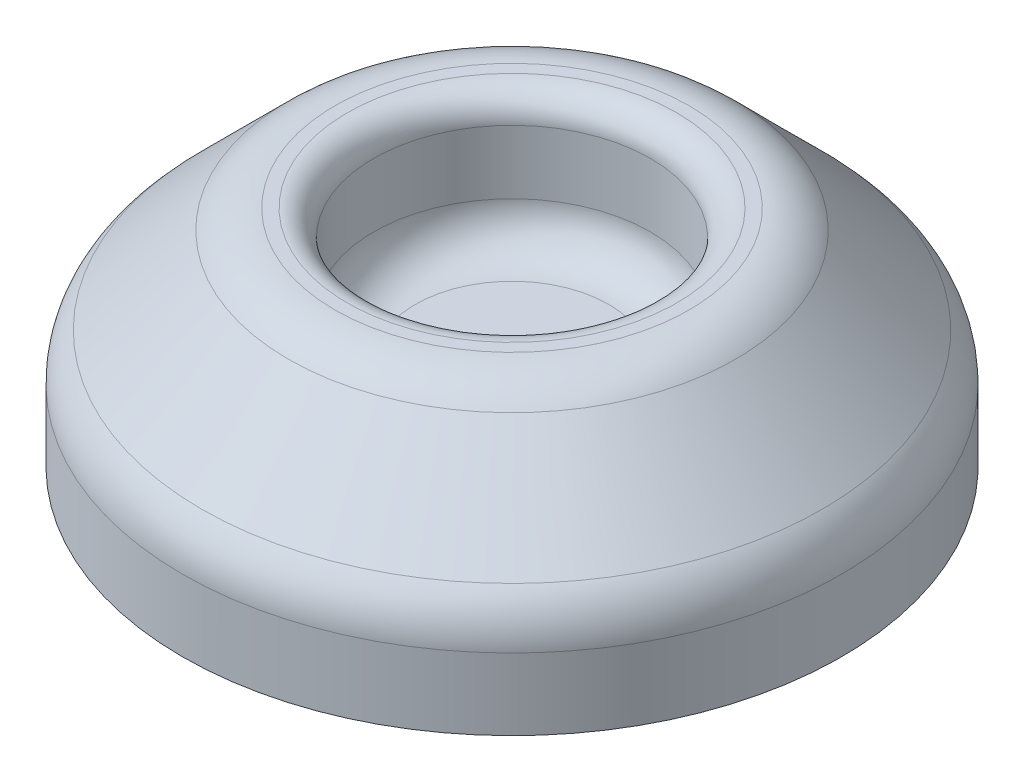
ISO-10303-21;
HEADER;
FILE_DESCRIPTION(('STEP AP214'),'2;1');
FILE_NAME('part.step','',(''),(''),'','','');
FILE_SCHEMA(('AUTOMOTIVE_DESIGN { 1 0 10303 214 1 1 1 1 }'));
ENDSEC;
DATA;
#1=APPLICATION_CONTEXT('core data for automotive mechanical design processes');
#2=APPLICATION_PROTOCOL_DEFINITION('international standard','automotive_design',2000,#1);
#3=PRODUCT_CONTEXT('',#1,'mechanical');
#4=PRODUCT('Part','Part','',(#3));
#5=PRODUCT_RELATED_PRODUCT_CATEGORY('part','',(#4));
#6=PRODUCT_DEFINITION_FORMATION('','',#4);
#7=PRODUCT_DEFINITION_CONTEXT('part definition',#1,'design');
#8=PRODUCT_DEFINITION('design','',#6,#7);
#9=PRODUCT_DEFINITION_SHAPE('','',#8);
#10=(LENGTH_UNIT() NAMED_UNIT(*) SI_UNIT(.MILLI.,.METRE.));
#11=(NAMED_UNIT(*) PLANE_ANGLE_UNIT() SI_UNIT($,.RADIAN.));
#12=(NAMED_UNIT(*) SI_UNIT($,.STERADIAN.) SOLID_ANGLE_UNIT());
#13=UNCERTAINTY_MEASURE_WITH_UNIT(LENGTH_MEASURE(1.E-05),#10,'distance_accuracy_value','');
#14=(GEOMETRIC_REPRESENTATION_CONTEXT(3) GLOBAL_UNCERTAINTY_ASSIGNED_CONTEXT((#13)) GLOBAL_UNIT_ASSIGNED_CONTEXT((#10,
#11,#12)) REPRESENTATION_CONTEXT('',''));
#15=CARTESIAN_POINT('',(0.,0.,0.));
#16=DIRECTION('',(0.,0.,1.));
#17=DIRECTION('',(1.,0.,0.));
#18=AXIS2_PLACEMENT_3D('',#15,#16,#17);
#19=CARTESIAN_POINT('',(0.,7.50000000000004,0.));
#20=DIRECTION('',(0.,-1.,0.));
#21=DIRECTION('',(0.,0.,-1.));
#22=AXIS2_PLACEMENT_3D('',#19,#20,#21);
#23=CONICAL_SURFACE('',#22,25.,0.78539816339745);
#24=CARTESIAN_POINT('',(0.,8.9644660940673,0.));
#25=DIRECTION('',(0.,1.,0.));
#26=DIRECTION('',(0.,0.,1.));
#27=AXIS2_PLACEMENT_3D('',#24,#25,#26);
#28=CIRCLE('',#27,23.5355339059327);
#29=CARTESIAN_POINT('',(0.,8.9644660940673,23.5355339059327));
#30=VERTEX_POINT('',#29);
#31=EDGE_CURVE('E57',#30,#30,#28,.T.);
#32=ORIENTED_EDGE('',*,*,#31,.T.);
#33=EDGE_LOOP('',(#32));
#34=FACE_BOUND('',#33,.T.);
#35=CARTESIAN_POINT('',(0.,15.5355339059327,0.));
#36=DIRECTION('',(0.,1.,0.));
#37=DIRECTION('',(0.,0.,1.));
#38=AXIS2_PLACEMENT_3D('',#35,#36,#37);
#39=CIRCLE('',#38,16.9644660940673);
#40=CARTESIAN_POINT('',(0.,15.5355339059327,16.9644660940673));
#41=VERTEX_POINT('',#40);
#42=EDGE_CURVE('E60',#41,#41,#39,.F.);
#43=ORIENTED_EDGE('',*,*,#42,.T.);
#44=EDGE_LOOP('',(#43));
#45=FACE_BOUND('',#44,.T.);
#46=ADVANCED_FACE('F31',(#34,#45),#23,.T.);
#47=CARTESIAN_POINT('',(15.5,17.,0.));
#48=DIRECTION('',(0.,-1.,0.));
#49=DIRECTION('',(0.,0.,-1.));
#50=AXIS2_PLACEMENT_3D('',#47,#48,#49);
#51=PLANE('',#50);
#52=CARTESIAN_POINT('',(0.,17.,0.));
#53=DIRECTION('',(0.,-1.,0.));
#54=DIRECTION('',(0.,0.,-1.));
#55=AXIS2_PLACEMENT_3D('',#52,#53,#54);
#56=CIRCLE('',#55,12.5);
#57=CARTESIAN_POINT('',(0.,17.,-12.5));
#58=VERTEX_POINT('',#57);
#59=EDGE_CURVE('E42',#58,#58,#56,.T.);
#60=ORIENTED_EDGE('',*,*,#59,.T.);
#61=EDGE_LOOP('',(#60));
#62=FACE_BOUND('',#61,.T.);
#63=CARTESIAN_POINT('',(0.,17.,0.));
#64=DIRECTION('',(0.,-1.,0.));
#65=DIRECTION('',(0.,0.,-1.));
#66=AXIS2_PLACEMENT_3D('',#63,#64,#65);
#67=CIRCLE('',#66,13.4289321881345);
#68=CARTESIAN_POINT('',(0.,17.,-13.4289321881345));
#69=VERTEX_POINT('',#68);
#70=EDGE_CURVE('E51',#69,#69,#67,.F.);
#71=ORIENTED_EDGE('',*,*,#70,.T.);
#72=EDGE_LOOP('',(#71));
#73=FACE_BOUND('',#72,.T.);
#74=ADVANCED_FACE('F122',(#62,#73),#51,.F.);
#75=CARTESIAN_POINT('',(0.,7.,0.));
#76=DIRECTION('',(0.,1.,0.));
#77=DIRECTION('',(0.,0.,1.));
#78=AXIS2_PLACEMENT_3D('',#75,#76,#77);
#79=CYLINDRICAL_SURFACE('',#78,10.5);
#80=CARTESIAN_POINT('',(0.,10.175,0.));
#81=DIRECTION('',(0.,-1.,0.));
#82=DIRECTION('',(0.,0.,-1.));
#83=AXIS2_PLACEMENT_3D('',#80,#81,#82);
#84=CIRCLE('',#83,10.5);
#85=CARTESIAN_POINT('',(0.,10.175,-10.5));
#86=VERTEX_POINT('',#85);
#87=EDGE_CURVE('E10',#86,#86,#84,.T.);
#88=ORIENTED_EDGE('',*,*,#87,.T.);
#89=EDGE_LOOP('',(#88));
#90=FACE_BOUND('',#89,.T.);
#91=CARTESIAN_POINT('',(0.,15.,0.));
#92=DIRECTION('',(0.,-1.,0.));
#93=DIRECTION('',(0.,0.,-1.));
#94=AXIS2_PLACEMENT_3D('',#91,#92,#93);
#95=CIRCLE('',#94,10.5);
#96=CARTESIAN_POINT('',(0.,15.,-10.5));
#97=VERTEX_POINT('',#96);
#98=EDGE_CURVE('E46',#97,#97,#95,.F.);
#99=ORIENTED_EDGE('',*,*,#98,.T.);
#100=EDGE_LOOP('',(#99));
#101=FACE_BOUND('',#100,.T.);
#102=ADVANCED_FACE('F128',(#90,#101),#79,.F.);
#103=CARTESIAN_POINT('',(10.5,7.,0.));
#104=DIRECTION('',(0.,-1.,0.));
#105=DIRECTION('',(0.,0.,-1.));
#106=AXIS2_PLACEMENT_3D('',#103,#104,#105);
#107=PLANE('',#106);
#108=CARTESIAN_POINT('',(0.,7.,0.));
#109=DIRECTION('',(0.,-1.,0.));
#110=DIRECTION('',(0.,0.,-1.));
#111=AXIS2_PLACEMENT_3D('',#108,#109,#110);
#112=CIRCLE('',#111,7.325);
#113=CARTESIAN_POINT('',(0.,7.,-7.325));
#114=VERTEX_POINT('',#113);
#115=EDGE_CURVE('E38',#114,#114,#112,.F.);
#116=ORIENTED_EDGE('',*,*,#115,.T.);
#117=EDGE_LOOP('',(#116));
#118=FACE_BOUND('',#117,.T.);
#119=ADVANCED_FACE('F154',(#118),#107,.F.);
#120=CARTESIAN_POINT('',(0.,0.,0.));
#121=DIRECTION('',(0.,1.,0.));
#122=DIRECTION('',(0.,0.,1.));
#123=AXIS2_PLACEMENT_3D('',#120,#121,#122);
#124=PLANE('',#123);
#125=CARTESIAN_POINT('',(0.,0.,0.));
#126=DIRECTION('',(0.,1.,0.));
#127=DIRECTION('',(0.,0.,1.));
#128=AXIS2_PLACEMENT_3D('',#125,#126,#127);
#129=CIRCLE('',#128,24.);
#130=CARTESIAN_POINT('',(0.,0.,24.));
#131=VERTEX_POINT('',#130);
#132=EDGE_CURVE('E67',#131,#131,#129,.T.);
#133=ORIENTED_EDGE('',*,*,#132,.T.);
#134=EDGE_LOOP('',(#133));
#135=FACE_BOUND('',#134,.T.);
#136=CARTESIAN_POINT('',(0.,0.,0.));
#137=DIRECTION('',(0.,1.,0.));
#138=DIRECTION('',(0.,0.,1.));
#139=AXIS2_PLACEMENT_3D('',#136,#137,#138);
#140=CIRCLE('',#139,25.);
#141=CARTESIAN_POINT('',(0.,0.,25.));
#142=VERTEX_POINT('',#141);
#143=EDGE_CURVE('E63',#142,#142,#140,.T.);
#144=ORIENTED_EDGE('',*,*,#143,.F.);
#145=EDGE_LOOP('',(#144));
#146=FACE_BOUND('',#145,.T.);
#147=ADVANCED_FACE('F158',(#135,#146),#124,.F.);
#148=CARTESIAN_POINT('',(0.,7.,0.));
#149=DIRECTION('',(0.,1.,0.));
#150=DIRECTION('',(0.,0.,1.));
#151=AXIS2_PLACEMENT_3D('',#148,#149,#150);
#152=CYLINDRICAL_SURFACE('',#151,25.);
#153=CARTESIAN_POINT('',(0.,5.42893218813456,0.));
#154=DIRECTION('',(0.,-1.,0.));
#155=DIRECTION('',(0.,0.,-1.));
#156=AXIS2_PLACEMENT_3D('',#153,#154,#155);
#157=CIRCLE('',#156,25.);
#158=CARTESIAN_POINT('',(0.,5.42893218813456,-25.));
#159=VERTEX_POINT('',#158);
#160=EDGE_CURVE('E54',#159,#159,#157,.T.);
#161=ORIENTED_EDGE('',*,*,#160,.T.);
#162=EDGE_LOOP('',(#161));
#163=FACE_BOUND('',#162,.T.);
#164=ORIENTED_EDGE('',*,*,#143,.T.);
#165=EDGE_LOOP('',(#164));
#166=FACE_BOUND('',#165,.T.);
#167=ADVANCED_FACE('F138',(#163,#166),#152,.T.);
#168=CARTESIAN_POINT('',(0.,5.42893218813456,0.));
#169=DIRECTION('',(0.,-1.,0.));
#170=DIRECTION('',(0.,0.,-1.));
#171=AXIS2_PLACEMENT_3D('',#168,#169,#170);
#172=TOROIDAL_SURFACE('',#171,20.,5.);
#173=ORIENTED_EDGE('',*,*,#160,.F.);
#174=EDGE_LOOP('',(#173));
#175=FACE_BOUND('',#174,.T.);
#176=ORIENTED_EDGE('',*,*,#31,.F.);
#177=EDGE_LOOP('',(#176));
#178=FACE_BOUND('',#177,.T.);
#179=ADVANCED_FACE('F134',(#175,#178),#172,.T.);
#180=CARTESIAN_POINT('',(0.,12.,0.));
#181=DIRECTION('',(0.,-1.,0.));
#182=DIRECTION('',(0.,0.,-1.));
#183=AXIS2_PLACEMENT_3D('',#180,#181,#182);
#184=TOROIDAL_SURFACE('',#183,13.4289321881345,5.);
#185=ORIENTED_EDGE('',*,*,#42,.F.);
#186=EDGE_LOOP('',(#185));
#187=FACE_BOUND('',#186,.T.);
#188=ORIENTED_EDGE('',*,*,#70,.F.);
#189=EDGE_LOOP('',(#188));
#190=FACE_BOUND('',#189,.T.);
#191=ADVANCED_FACE('F137',(#187,#190),#184,.T.);
#192=CARTESIAN_POINT('',(0.,15.,0.));
#193=DIRECTION('',(0.,-1.,0.));
#194=DIRECTION('',(0.,0.,-1.));
#195=AXIS2_PLACEMENT_3D('',#192,#193,#194);
#196=TOROIDAL_SURFACE('',#195,12.5,2.);
#197=ORIENTED_EDGE('',*,*,#59,.F.);
#198=EDGE_LOOP('',(#197));
#199=FACE_BOUND('',#198,.T.);
#200=ORIENTED_EDGE('',*,*,#98,.F.);
#201=EDGE_LOOP('',(#200));
#202=FACE_BOUND('',#201,.T.);
#203=ADVANCED_FACE('F141',(#199,#202),#196,.T.);
#204=CARTESIAN_POINT('',(0.,10.175,0.));
#205=DIRECTION('',(0.,-1.,0.));
#206=DIRECTION('',(0.,0.,-1.));
#207=AXIS2_PLACEMENT_3D('',#204,#205,#206);
#208=TOROIDAL_SURFACE('',#207,7.325,3.175);
#209=ORIENTED_EDGE('',*,*,#87,.F.);
#210=EDGE_LOOP('',(#209));
#211=FACE_BOUND('',#210,.T.);
#212=ORIENTED_EDGE('',*,*,#115,.F.);
#213=EDGE_LOOP('',(#212));
#214=FACE_BOUND('',#213,.T.);
#215=ADVANCED_FACE('F33',(#211,#214),#208,.F.);
#216=CARTESIAN_POINT('',(0.,6.79289321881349,0.));
#217=DIRECTION('',(0.,-1.,0.));
#218=DIRECTION('',(0.,0.,-1.));
#219=AXIS2_PLACEMENT_3D('',#216,#217,#218);
#220=CONICAL_SURFACE('',#219,24.2928932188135,0.78539816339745);
#221=CARTESIAN_POINT('',(0.,8.25735931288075,0.));
#222=DIRECTION('',(0.,-1.,0.));
#223=DIRECTION('',(0.,0.,-1.));
#224=AXIS2_PLACEMENT_3D('',#221,#222,#223);
#225=CIRCLE('',#224,22.8284271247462);
#226=CARTESIAN_POINT('',(0.,8.25735931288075,-22.8284271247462));
#227=VERTEX_POINT('',#226);
#228=EDGE_CURVE('E88',#227,#227,#225,.F.);
#229=ORIENTED_EDGE('',*,*,#228,.F.);
#230=EDGE_LOOP('',(#229));
#231=FACE_BOUND('',#230,.T.);
#232=CARTESIAN_POINT('',(0.,14.8284271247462,0.));
#233=DIRECTION('',(0.,-1.,0.));
#234=DIRECTION('',(0.,0.,-1.));
#235=AXIS2_PLACEMENT_3D('',#232,#233,#234);
#236=CIRCLE('',#235,16.2573593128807);
#237=CARTESIAN_POINT('',(0.,14.8284271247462,-16.2573593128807));
#238=VERTEX_POINT('',#237);
#239=EDGE_CURVE('E70',#238,#238,#236,.T.);
#240=ORIENTED_EDGE('',*,*,#239,.F.);
#241=EDGE_LOOP('',(#240));
#242=FACE_BOUND('',#241,.T.);
#243=ADVANCED_FACE('F96',(#231,#242),#220,.F.);
#244=CARTESIAN_POINT('',(15.5,16.,0.));
#245=DIRECTION('',(0.,-1.,0.));
#246=DIRECTION('',(0.,0.,-1.));
#247=AXIS2_PLACEMENT_3D('',#244,#245,#246);
#248=PLANE('',#247);
#249=CARTESIAN_POINT('',(0.,16.,0.));
#250=DIRECTION('',(0.,-1.,0.));
#251=DIRECTION('',(0.,0.,-1.));
#252=AXIS2_PLACEMENT_3D('',#249,#250,#251);
#253=CIRCLE('',#252,12.5);
#254=CARTESIAN_POINT('',(0.,16.,-12.5));
#255=VERTEX_POINT('',#254);
#256=EDGE_CURVE('E74',#255,#255,#253,.T.);
#257=ORIENTED_EDGE('',*,*,#256,.F.);
#258=EDGE_LOOP('',(#257));
#259=FACE_BOUND('',#258,.T.);
#260=CARTESIAN_POINT('',(0.,16.,0.));
#261=DIRECTION('',(0.,-1.,0.));
#262=DIRECTION('',(0.,0.,-1.));
#263=AXIS2_PLACEMENT_3D('',#260,#261,#262);
#264=CIRCLE('',#263,13.4289321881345);
#265=CARTESIAN_POINT('',(0.,16.,-13.4289321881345));
#266=VERTEX_POINT('',#265);
#267=EDGE_CURVE('E80',#266,#266,#264,.F.);
#268=ORIENTED_EDGE('',*,*,#267,.F.);
#269=EDGE_LOOP('',(#268));
#270=FACE_BOUND('',#269,.T.);
#271=ADVANCED_FACE('F99',(#259,#270),#248,.T.);
#272=CARTESIAN_POINT('',(0.,7.,0.));
#273=DIRECTION('',(0.,1.,0.));
#274=DIRECTION('',(0.,0.,1.));
#275=AXIS2_PLACEMENT_3D('',#272,#273,#274);
#276=CYLINDRICAL_SURFACE('',#275,11.5);
#277=CARTESIAN_POINT('',(0.,10.175,0.));
#278=DIRECTION('',(0.,1.,0.));
#279=DIRECTION('',(0.,0.,1.));
#280=AXIS2_PLACEMENT_3D('',#277,#278,#279);
#281=CIRCLE('',#280,11.5);
#282=CARTESIAN_POINT('',(0.,10.175,11.5));
#283=VERTEX_POINT('',#282);
#284=EDGE_CURVE('E66',#283,#283,#281,.F.);
#285=ORIENTED_EDGE('',*,*,#284,.F.);
#286=EDGE_LOOP('',(#285));
#287=FACE_BOUND('',#286,.T.);
#288=CARTESIAN_POINT('',(0.,15.,0.));
#289=DIRECTION('',(0.,1.,0.));
#290=DIRECTION('',(0.,0.,1.));
#291=AXIS2_PLACEMENT_3D('',#288,#289,#290);
#292=CIRCLE('',#291,11.5);
#293=CARTESIAN_POINT('',(0.,15.,11.5));
#294=VERTEX_POINT('',#293);
#295=EDGE_CURVE('E77',#294,#294,#292,.T.);
#296=ORIENTED_EDGE('',*,*,#295,.F.);
#297=EDGE_LOOP('',(#296));
#298=FACE_BOUND('',#297,.T.);
#299=ADVANCED_FACE('F111',(#287,#298),#276,.T.);
#300=CARTESIAN_POINT('',(10.5,6.,0.));
#301=DIRECTION('',(0.,-1.,0.));
#302=DIRECTION('',(0.,0.,-1.));
#303=AXIS2_PLACEMENT_3D('',#300,#301,#302);
#304=PLANE('',#303);
#305=CARTESIAN_POINT('',(0.,6.,0.));
#306=DIRECTION('',(0.,-1.,0.));
#307=DIRECTION('',(0.,0.,-1.));
#308=AXIS2_PLACEMENT_3D('',#305,#306,#307);
#309=CIRCLE('',#308,7.325);
#310=CARTESIAN_POINT('',(0.,6.,-7.325));
#311=VERTEX_POINT('',#310);
#312=EDGE_CURVE('E71',#311,#311,#309,.F.);
#313=ORIENTED_EDGE('',*,*,#312,.F.);
#314=EDGE_LOOP('',(#313));
#315=FACE_BOUND('',#314,.T.);
#316=ADVANCED_FACE('F117',(#315),#304,.T.);
#317=CARTESIAN_POINT('',(0.,7.,0.));
#318=DIRECTION('',(0.,1.,0.));
#319=DIRECTION('',(0.,0.,1.));
#320=AXIS2_PLACEMENT_3D('',#317,#318,#319);
#321=CYLINDRICAL_SURFACE('',#320,24.);
#322=CARTESIAN_POINT('',(0.,5.42893218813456,0.));
#323=DIRECTION('',(0.,1.,0.));
#324=DIRECTION('',(0.,0.,1.));
#325=AXIS2_PLACEMENT_3D('',#322,#323,#324);
#326=CIRCLE('',#325,24.);
#327=CARTESIAN_POINT('',(0.,5.42893218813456,24.));
#328=VERTEX_POINT('',#327);
#329=EDGE_CURVE('E85',#328,#328,#326,.F.);
#330=ORIENTED_EDGE('',*,*,#329,.F.);
#331=EDGE_LOOP('',(#330));
#332=FACE_BOUND('',#331,.T.);
#333=ORIENTED_EDGE('',*,*,#132,.F.);
#334=EDGE_LOOP('',(#333));
#335=FACE_BOUND('',#334,.T.);
#336=ADVANCED_FACE('F176',(#332,#335),#321,.F.);
#337=CARTESIAN_POINT('',(0.,5.42893218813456,0.));
#338=DIRECTION('',(0.,-1.,0.));
#339=DIRECTION('',(0.,0.,-1.));
#340=AXIS2_PLACEMENT_3D('',#337,#338,#339);
#341=TOROIDAL_SURFACE('',#340,20.,4.);
#342=ORIENTED_EDGE('',*,*,#329,.T.);
#343=EDGE_LOOP('',(#342));
#344=FACE_BOUND('',#343,.T.);
#345=ORIENTED_EDGE('',*,*,#228,.T.);
#346=EDGE_LOOP('',(#345));
#347=FACE_BOUND('',#346,.T.);
#348=ADVANCED_FACE('F94',(#344,#347),#341,.F.);
#349=CARTESIAN_POINT('',(0.,12.,0.));
#350=DIRECTION('',(0.,-1.,0.));
#351=DIRECTION('',(0.,0.,-1.));
#352=AXIS2_PLACEMENT_3D('',#349,#350,#351);
#353=TOROIDAL_SURFACE('',#352,13.4289321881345,4.);
#354=ORIENTED_EDGE('',*,*,#239,.T.);
#355=EDGE_LOOP('',(#354));
#356=FACE_BOUND('',#355,.T.);
#357=ORIENTED_EDGE('',*,*,#267,.T.);
#358=EDGE_LOOP('',(#357));
#359=FACE_BOUND('',#358,.T.);
#360=ADVANCED_FACE('F103',(#356,#359),#353,.F.);
#361=CARTESIAN_POINT('',(0.,15.,0.));
#362=DIRECTION('',(0.,-1.,0.));
#363=DIRECTION('',(0.,0.,-1.));
#364=AXIS2_PLACEMENT_3D('',#361,#362,#363);
#365=TOROIDAL_SURFACE('',#364,12.5,1.);
#366=ORIENTED_EDGE('',*,*,#256,.T.);
#367=EDGE_LOOP('',(#366));
#368=FACE_BOUND('',#367,.T.);
#369=ORIENTED_EDGE('',*,*,#295,.T.);
#370=EDGE_LOOP('',(#369));
#371=FACE_BOUND('',#370,.T.);
#372=ADVANCED_FACE('F106',(#368,#371),#365,.F.);
#373=CARTESIAN_POINT('',(0.,10.175,0.));
#374=DIRECTION('',(0.,-1.,0.));
#375=DIRECTION('',(0.,0.,-1.));
#376=AXIS2_PLACEMENT_3D('',#373,#374,#375);
#377=TOROIDAL_SURFACE('',#376,7.325,4.175);
#378=ORIENTED_EDGE('',*,*,#284,.T.);
#379=EDGE_LOOP('',(#378));
#380=FACE_BOUND('',#379,.T.);
#381=ORIENTED_EDGE('',*,*,#312,.T.);
#382=EDGE_LOOP('',(#381));
#383=FACE_BOUND('',#382,.T.);
#384=ADVANCED_FACE('F167',(#380,#383),#377,.T.);
#385=CLOSED_SHELL('',(#46,#74,#102,#119,#147,#167,#179,#191,#203,#215,#243,#271,#299,#316,#336,
#348,#360,#372,#384));
#386=MANIFOLD_SOLID_BREP('B2',#385);
#387=ADVANCED_BREP_SHAPE_REPRESENTATION('',(#18,#386),#14);
#388=SHAPE_DEFINITION_REPRESENTATION(#9,#387);
ENDSEC;
END-ISO-10303-21;
